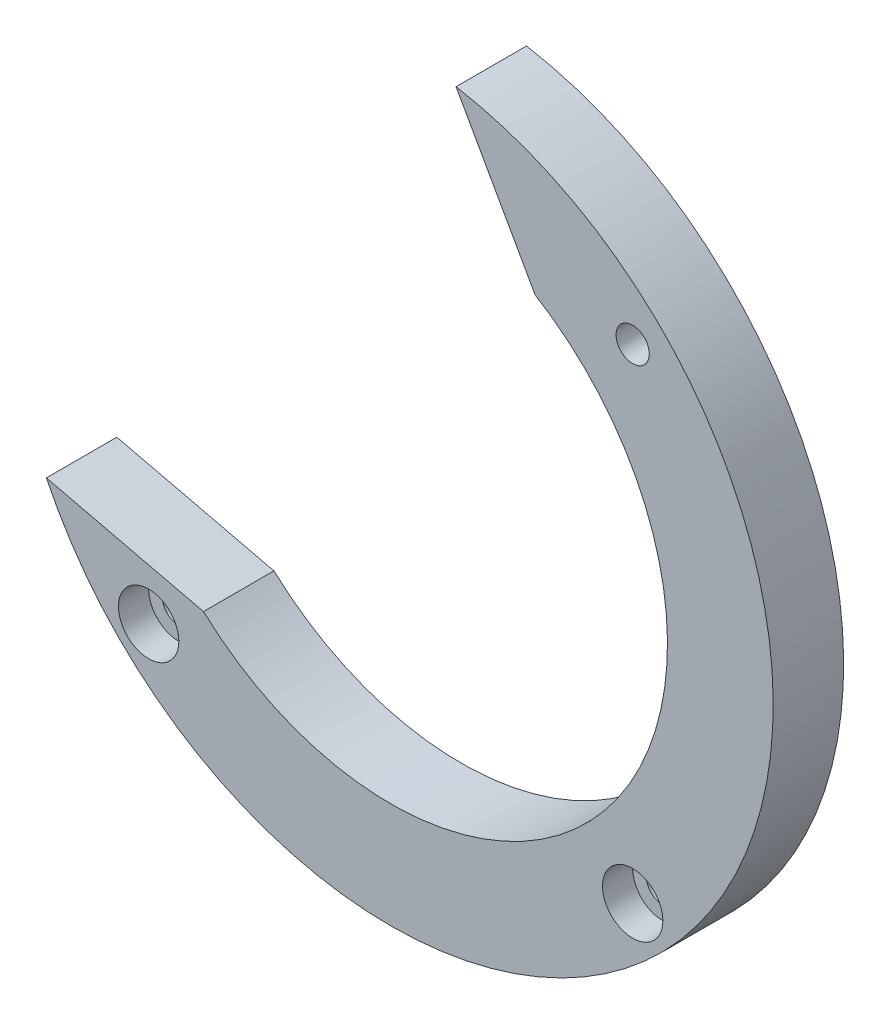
ISO-10303-21;
HEADER;
FILE_DESCRIPTION(('STEP AP214'),'2;1');
FILE_NAME('part.step','',(''),(''),'','','');
FILE_SCHEMA(('AUTOMOTIVE_DESIGN { 1 0 10303 214 1 1 1 1 }'));
ENDSEC;
DATA;
#1=APPLICATION_CONTEXT('core data for automotive mechanical design processes');
#2=APPLICATION_PROTOCOL_DEFINITION('international standard','automotive_design',2000,#1);
#3=PRODUCT_CONTEXT('',#1,'mechanical');
#4=PRODUCT('Part','Part','',(#3));
#5=PRODUCT_RELATED_PRODUCT_CATEGORY('part','',(#4));
#6=PRODUCT_DEFINITION_FORMATION('','',#4);
#7=PRODUCT_DEFINITION_CONTEXT('part definition',#1,'design');
#8=PRODUCT_DEFINITION('design','',#6,#7);
#9=PRODUCT_DEFINITION_SHAPE('','',#8);
#10=(LENGTH_UNIT() NAMED_UNIT(*) SI_UNIT(.MILLI.,.METRE.));
#11=(NAMED_UNIT(*) PLANE_ANGLE_UNIT() SI_UNIT($,.RADIAN.));
#12=(NAMED_UNIT(*) SI_UNIT($,.STERADIAN.) SOLID_ANGLE_UNIT());
#13=UNCERTAINTY_MEASURE_WITH_UNIT(LENGTH_MEASURE(1.E-05),#10,'distance_accuracy_value','');
#14=(GEOMETRIC_REPRESENTATION_CONTEXT(3) GLOBAL_UNCERTAINTY_ASSIGNED_CONTEXT((#13)) GLOBAL_UNIT_ASSIGNED_CONTEXT((#10,
#11,#12)) REPRESENTATION_CONTEXT('',''));
#15=CARTESIAN_POINT('',(0.,0.,0.));
#16=DIRECTION('',(0.,0.,1.));
#17=DIRECTION('',(1.,0.,0.));
#18=AXIS2_PLACEMENT_3D('',#15,#16,#17);
#19=CARTESIAN_POINT('',(-24.0416305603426,-24.0416305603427,4.));
#20=DIRECTION('',(0.,0.,1.));
#21=DIRECTION('',(1.,0.,0.));
#22=AXIS2_PLACEMENT_3D('',#19,#20,#21);
#23=PLANE('',#22);
#24=CARTESIAN_POINT('',(-24.0416305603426,-24.0416305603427,4.));
#25=DIRECTION('',(0.,0.,1.));
#26=DIRECTION('',(1.,0.,0.));
#27=AXIS2_PLACEMENT_3D('',#24,#25,#26);
#28=CIRCLE('',#27,1.65);
#29=CARTESIAN_POINT('',(-22.3916305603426,-24.0416305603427,4.));
#30=VERTEX_POINT('',#29);
#31=EDGE_CURVE('E117',#30,#30,#28,.T.);
#32=ORIENTED_EDGE('',*,*,#31,.F.);
#33=EDGE_LOOP('',(#32));
#34=FACE_BOUND('',#33,.T.);
#35=CARTESIAN_POINT('',(-24.0416305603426,-24.0416305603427,4.));
#36=DIRECTION('',(0.,0.,1.));
#37=DIRECTION('',(1.,0.,0.));
#38=AXIS2_PLACEMENT_3D('',#35,#36,#37);
#39=CIRCLE('',#38,3.);
#40=CARTESIAN_POINT('',(-21.0416305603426,-24.0416305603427,4.));
#41=VERTEX_POINT('',#40);
#42=EDGE_CURVE('E254',#41,#41,#39,.T.);
#43=ORIENTED_EDGE('',*,*,#42,.T.);
#44=EDGE_LOOP('',(#43));
#45=FACE_BOUND('',#44,.T.);
#46=ADVANCED_FACE('F17',(#34,#45),#23,.T.);
#47=CARTESIAN_POINT('',(24.0416305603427,-24.0416305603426,4.));
#48=DIRECTION('',(0.,0.,1.));
#49=DIRECTION('',(1.,0.,0.));
#50=AXIS2_PLACEMENT_3D('',#47,#48,#49);
#51=PLANE('',#50);
#52=CARTESIAN_POINT('',(24.0416305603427,-24.0416305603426,4.));
#53=DIRECTION('',(0.,0.,1.));
#54=DIRECTION('',(1.,0.,0.));
#55=AXIS2_PLACEMENT_3D('',#52,#53,#54);
#56=CIRCLE('',#55,1.65);
#57=CARTESIAN_POINT('',(25.6916305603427,-24.0416305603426,4.));
#58=VERTEX_POINT('',#57);
#59=EDGE_CURVE('E122',#58,#58,#56,.T.);
#60=ORIENTED_EDGE('',*,*,#59,.F.);
#61=EDGE_LOOP('',(#60));
#62=FACE_BOUND('',#61,.T.);
#63=CARTESIAN_POINT('',(24.0416305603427,-24.0416305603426,4.));
#64=DIRECTION('',(0.,0.,1.));
#65=DIRECTION('',(1.,0.,0.));
#66=AXIS2_PLACEMENT_3D('',#63,#64,#65);
#67=CIRCLE('',#66,3.);
#68=CARTESIAN_POINT('',(27.0416305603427,-24.0416305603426,4.));
#69=VERTEX_POINT('',#68);
#70=EDGE_CURVE('E106',#69,#69,#67,.T.);
#71=ORIENTED_EDGE('',*,*,#70,.T.);
#72=EDGE_LOOP('',(#71));
#73=FACE_BOUND('',#72,.T.);
#74=ADVANCED_FACE('F429',(#62,#73),#51,.T.);
#75=CARTESIAN_POINT('',(0.,0.,7.));
#76=DIRECTION('',(0.,0.,1.));
#77=DIRECTION('',(1.,0.,0.));
#78=AXIS2_PLACEMENT_3D('',#75,#76,#77);
#79=PLANE('',#78);
#80=CARTESIAN_POINT('',(24.0416305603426,24.0416305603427,7.));
#81=DIRECTION('',(0.,0.,1.));
#82=DIRECTION('',(1.,0.,0.));
#83=AXIS2_PLACEMENT_3D('',#80,#81,#82);
#84=CIRCLE('',#83,1.65);
#85=CARTESIAN_POINT('',(25.6916305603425,24.0416305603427,7.));
#86=VERTEX_POINT('',#85);
#87=EDGE_CURVE('E112',#86,#86,#84,.T.);
#88=ORIENTED_EDGE('',*,*,#87,.F.);
#89=EDGE_LOOP('',(#88));
#90=FACE_BOUND('',#89,.T.);
#91=CARTESIAN_POINT('',(24.0416305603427,-24.0416305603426,7.));
#92=DIRECTION('',(0.,0.,1.));
#93=DIRECTION('',(1.,0.,0.));
#94=AXIS2_PLACEMENT_3D('',#91,#92,#93);
#95=CIRCLE('',#94,3.);
#96=CARTESIAN_POINT('',(27.0416305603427,-24.0416305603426,7.));
#97=VERTEX_POINT('',#96);
#98=EDGE_CURVE('E108',#97,#97,#95,.T.);
#99=ORIENTED_EDGE('',*,*,#98,.F.);
#100=EDGE_LOOP('',(#99));
#101=FACE_BOUND('',#100,.T.);
#102=CARTESIAN_POINT('',(-24.0416305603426,-24.0416305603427,7.));
#103=DIRECTION('',(0.,0.,1.));
#104=DIRECTION('',(1.,0.,0.));
#105=AXIS2_PLACEMENT_3D('',#102,#103,#104);
#106=CIRCLE('',#105,3.);
#107=CARTESIAN_POINT('',(-21.0416305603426,-24.0416305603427,7.));
#108=VERTEX_POINT('',#107);
#109=EDGE_CURVE('E232',#108,#108,#106,.T.);
#110=ORIENTED_EDGE('',*,*,#109,.F.);
#111=EDGE_LOOP('',(#110));
#112=FACE_BOUND('',#111,.T.);
#113=CARTESIAN_POINT('',(0.,0.,7.));
#114=DIRECTION('',(0.,0.,-1.));
#115=DIRECTION('',(1.,0.,0.));
#116=AXIS2_PLACEMENT_3D('',#113,#114,#115);
#117=CIRCLE('',#116,27.5);
#118=CARTESIAN_POINT('',(14.3472547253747,23.4607391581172,7.));
#119=VERTEX_POINT('',#118);
#120=CARTESIAN_POINT('',(-18.5972705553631,-20.2581225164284,7.));
#121=VERTEX_POINT('',#120);
#122=EDGE_CURVE('E11',#119,#121,#117,.T.);
#123=ORIENTED_EDGE('',*,*,#122,.T.);
#124=DIRECTION('',(-0.973060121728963,0.230551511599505,0.));
#125=VECTOR('',#124,1.);
#126=CARTESIAN_POINT('',(-18.5972705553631,-20.2581225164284,7.));
#127=LINE('',#126,#125);
#128=CARTESIAN_POINT('',(-34.2013776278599,-16.560971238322,7.));
#129=VERTEX_POINT('',#128);
#130=EDGE_CURVE('E102',#121,#129,#127,.T.);
#131=ORIENTED_EDGE('',*,*,#130,.T.);
#132=CARTESIAN_POINT('',(0.,0.,7.));
#133=DIRECTION('',(0.,0.,1.));
#134=DIRECTION('',(1.,0.,0.));
#135=AXIS2_PLACEMENT_3D('',#132,#133,#134);
#136=CIRCLE('',#135,38.);
#137=CARTESIAN_POINT('',(6.49225000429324,37.4412965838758,7.));
#138=VERTEX_POINT('',#137);
#139=EDGE_CURVE('E80',#129,#138,#136,.T.);
#140=ORIENTED_EDGE('',*,*,#139,.T.);
#141=DIRECTION('',(0.48983205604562,-0.871816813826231,0.));
#142=VECTOR('',#141,1.);
#143=CARTESIAN_POINT('',(6.49225000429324,37.4412965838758,7.));
#144=LINE('',#143,#142);
#145=EDGE_CURVE('E85',#138,#119,#144,.T.);
#146=ORIENTED_EDGE('',*,*,#145,.T.);
#147=EDGE_LOOP('',(#123,#131,#140,#146));
#148=FACE_BOUND('',#147,.T.);
#149=ADVANCED_FACE('F434',(#90,#101,#112,#148),#79,.T.);
#150=CARTESIAN_POINT('',(0.,0.,0.));
#151=DIRECTION('',(0.,0.,1.));
#152=DIRECTION('',(1.,0.,0.));
#153=AXIS2_PLACEMENT_3D('',#150,#151,#152);
#154=PLANE('',#153);
#155=CARTESIAN_POINT('',(24.0416305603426,24.0416305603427,0.));
#156=DIRECTION('',(0.,0.,1.));
#157=DIRECTION('',(1.,0.,0.));
#158=AXIS2_PLACEMENT_3D('',#155,#156,#157);
#159=CIRCLE('',#158,1.65);
#160=CARTESIAN_POINT('',(25.6916305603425,24.0416305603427,0.));
#161=VERTEX_POINT('',#160);
#162=EDGE_CURVE('E116',#161,#161,#159,.T.);
#163=ORIENTED_EDGE('',*,*,#162,.T.);
#164=EDGE_LOOP('',(#163));
#165=FACE_BOUND('',#164,.T.);
#166=CARTESIAN_POINT('',(24.0416305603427,-24.0416305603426,0.));
#167=DIRECTION('',(0.,0.,1.));
#168=DIRECTION('',(1.,0.,0.));
#169=AXIS2_PLACEMENT_3D('',#166,#167,#168);
#170=CIRCLE('',#169,1.65);
#171=CARTESIAN_POINT('',(25.6916305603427,-24.0416305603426,0.));
#172=VERTEX_POINT('',#171);
#173=EDGE_CURVE('E126',#172,#172,#170,.T.);
#174=ORIENTED_EDGE('',*,*,#173,.T.);
#175=EDGE_LOOP('',(#174));
#176=FACE_BOUND('',#175,.T.);
#177=CARTESIAN_POINT('',(-24.0416305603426,-24.0416305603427,0.));
#178=DIRECTION('',(0.,0.,1.));
#179=DIRECTION('',(1.,0.,0.));
#180=AXIS2_PLACEMENT_3D('',#177,#178,#179);
#181=CIRCLE('',#180,1.65);
#182=CARTESIAN_POINT('',(-22.3916305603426,-24.0416305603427,0.));
#183=VERTEX_POINT('',#182);
#184=EDGE_CURVE('E121',#183,#183,#181,.T.);
#185=ORIENTED_EDGE('',*,*,#184,.T.);
#186=EDGE_LOOP('',(#185));
#187=FACE_BOUND('',#186,.T.);
#188=DIRECTION('',(0.973060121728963,-0.230551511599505,0.));
#189=VECTOR('',#188,1.);
#190=CARTESIAN_POINT('',(-5.53323627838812,-23.3534429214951,0.));
#191=LINE('',#190,#189);
#192=CARTESIAN_POINT('',(-34.2013776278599,-16.560971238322,0.));
#193=VERTEX_POINT('',#192);
#194=CARTESIAN_POINT('',(-18.5972705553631,-20.2581225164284,0.));
#195=VERTEX_POINT('',#194);
#196=EDGE_CURVE('E130',#193,#195,#191,.T.);
#197=ORIENTED_EDGE('',*,*,#196,.T.);
#198=CARTESIAN_POINT('',(0.,0.,0.));
#199=DIRECTION('',(0.,0.,1.));
#200=DIRECTION('',(1.,0.,0.));
#201=AXIS2_PLACEMENT_3D('',#198,#199,#200);
#202=CIRCLE('',#201,27.5);
#203=CARTESIAN_POINT('',(14.3472547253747,23.4607391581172,0.));
#204=VERTEX_POINT('',#203);
#205=EDGE_CURVE('E25',#195,#204,#202,.T.);
#206=ORIENTED_EDGE('',*,*,#205,.T.);
#207=DIRECTION('',(-0.489832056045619,0.871816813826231,0.));
#208=VECTOR('',#207,1.);
#209=CARTESIAN_POINT('',(20.9236035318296,11.7559693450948,0.));
#210=LINE('',#209,#208);
#211=CARTESIAN_POINT('',(6.49225000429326,37.4412965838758,0.));
#212=VERTEX_POINT('',#211);
#213=EDGE_CURVE('E70',#204,#212,#210,.T.);
#214=ORIENTED_EDGE('',*,*,#213,.T.);
#215=CARTESIAN_POINT('',(0.,0.,0.));
#216=DIRECTION('',(0.,0.,1.));
#217=DIRECTION('',(1.,0.,0.));
#218=AXIS2_PLACEMENT_3D('',#215,#216,#217);
#219=CIRCLE('',#218,38.);
#220=EDGE_CURVE('E74',#193,#212,#219,.T.);
#221=ORIENTED_EDGE('',*,*,#220,.F.);
#222=EDGE_LOOP('',(#197,#206,#214,#221));
#223=FACE_BOUND('',#222,.T.);
#224=ADVANCED_FACE('F72',(#165,#176,#187,#223),#154,.F.);
#225=CARTESIAN_POINT('',(0.,0.,2.));
#226=DIRECTION('',(0.,0.,-1.));
#227=DIRECTION('',(-1.,0.,0.));
#228=AXIS2_PLACEMENT_3D('',#225,#226,#227);
#229=CYLINDRICAL_SURFACE('',#228,27.5);
#230=ORIENTED_EDGE('',*,*,#205,.F.);
#231=DIRECTION('',(0.,0.,-1.));
#232=VECTOR('',#231,1.);
#233=CARTESIAN_POINT('',(-18.5972705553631,-20.2581225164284,2.));
#234=LINE('',#233,#232);
#235=EDGE_CURVE('E95',#121,#195,#234,.T.);
#236=ORIENTED_EDGE('',*,*,#235,.F.);
#237=ORIENTED_EDGE('',*,*,#122,.F.);
#238=DIRECTION('',(0.,0.,-1.));
#239=VECTOR('',#238,1.);
#240=CARTESIAN_POINT('',(14.3472547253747,23.4607391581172,2.));
#241=LINE('',#240,#239);
#242=EDGE_CURVE('E79',#119,#204,#241,.T.);
#243=ORIENTED_EDGE('',*,*,#242,.T.);
#244=EDGE_LOOP('',(#230,#236,#237,#243));
#245=FACE_BOUND('',#244,.T.);
#246=ADVANCED_FACE('F452',(#245),#229,.F.);
#247=CARTESIAN_POINT('',(20.9236035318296,11.7559693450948,2.));
#248=DIRECTION('',(-0.871816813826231,-0.489832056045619,0.));
#249=DIRECTION('',(-0.489832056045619,0.871816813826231,0.));
#250=AXIS2_PLACEMENT_3D('',#247,#248,#249);
#251=PLANE('',#250);
#252=ORIENTED_EDGE('',*,*,#213,.F.);
#253=ORIENTED_EDGE('',*,*,#242,.F.);
#254=ORIENTED_EDGE('',*,*,#145,.F.);
#255=DIRECTION('',(0.,0.,-1.));
#256=VECTOR('',#255,1.);
#257=CARTESIAN_POINT('',(6.49225000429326,37.4412965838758,2.));
#258=LINE('',#257,#256);
#259=EDGE_CURVE('E83',#138,#212,#258,.T.);
#260=ORIENTED_EDGE('',*,*,#259,.T.);
#261=EDGE_LOOP('',(#252,#253,#254,#260));
#262=FACE_BOUND('',#261,.T.);
#263=ADVANCED_FACE('F84',(#262),#251,.T.);
#264=CARTESIAN_POINT('',(0.,0.,2.));
#265=DIRECTION('',(0.,0.,-1.));
#266=DIRECTION('',(-1.,0.,0.));
#267=AXIS2_PLACEMENT_3D('',#264,#265,#266);
#268=CYLINDRICAL_SURFACE('',#267,38.);
#269=ORIENTED_EDGE('',*,*,#220,.T.);
#270=ORIENTED_EDGE('',*,*,#259,.F.);
#271=ORIENTED_EDGE('',*,*,#139,.F.);
#272=DIRECTION('',(0.,0.,-1.));
#273=VECTOR('',#272,1.);
#274=CARTESIAN_POINT('',(-34.2013776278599,-16.560971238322,2.));
#275=LINE('',#274,#273);
#276=EDGE_CURVE('E92',#129,#193,#275,.T.);
#277=ORIENTED_EDGE('',*,*,#276,.T.);
#278=EDGE_LOOP('',(#269,#270,#271,#277));
#279=FACE_BOUND('',#278,.T.);
#280=ADVANCED_FACE('F90',(#279),#268,.T.);
#281=CARTESIAN_POINT('',(-5.53323627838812,-23.3534429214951,2.));
#282=DIRECTION('',(0.230551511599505,0.973060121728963,0.));
#283=DIRECTION('',(0.,0.,-1.));
#284=AXIS2_PLACEMENT_3D('',#281,#282,#283);
#285=PLANE('',#284);
#286=ORIENTED_EDGE('',*,*,#196,.F.);
#287=ORIENTED_EDGE('',*,*,#276,.F.);
#288=ORIENTED_EDGE('',*,*,#130,.F.);
#289=ORIENTED_EDGE('',*,*,#235,.T.);
#290=EDGE_LOOP('',(#286,#287,#288,#289));
#291=FACE_BOUND('',#290,.T.);
#292=ADVANCED_FACE('F338',(#291),#285,.T.);
#293=CARTESIAN_POINT('',(24.0416305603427,-24.0416305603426,2.));
#294=DIRECTION('',(0.,0.,-1.));
#295=DIRECTION('',(-1.,0.,0.));
#296=AXIS2_PLACEMENT_3D('',#293,#294,#295);
#297=CYLINDRICAL_SURFACE('',#296,1.65);
#298=ORIENTED_EDGE('',*,*,#173,.F.);
#299=EDGE_LOOP('',(#298));
#300=FACE_BOUND('',#299,.T.);
#301=ORIENTED_EDGE('',*,*,#59,.T.);
#302=EDGE_LOOP('',(#301));
#303=FACE_BOUND('',#302,.T.);
#304=ADVANCED_FACE('F327',(#300,#303),#297,.F.);
#305=CARTESIAN_POINT('',(-24.0416305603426,-24.0416305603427,2.));
#306=DIRECTION('',(0.,0.,-1.));
#307=DIRECTION('',(-1.,0.,0.));
#308=AXIS2_PLACEMENT_3D('',#305,#306,#307);
#309=CYLINDRICAL_SURFACE('',#308,1.65);
#310=ORIENTED_EDGE('',*,*,#184,.F.);
#311=EDGE_LOOP('',(#310));
#312=FACE_BOUND('',#311,.T.);
#313=ORIENTED_EDGE('',*,*,#31,.T.);
#314=EDGE_LOOP('',(#313));
#315=FACE_BOUND('',#314,.T.);
#316=ADVANCED_FACE('F315',(#312,#315),#309,.F.);
#317=CARTESIAN_POINT('',(24.0416305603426,24.0416305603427,2.));
#318=DIRECTION('',(0.,0.,-1.));
#319=DIRECTION('',(-1.,0.,0.));
#320=AXIS2_PLACEMENT_3D('',#317,#318,#319);
#321=CYLINDRICAL_SURFACE('',#320,1.65);
#322=ORIENTED_EDGE('',*,*,#162,.F.);
#323=EDGE_LOOP('',(#322));
#324=FACE_BOUND('',#323,.T.);
#325=ORIENTED_EDGE('',*,*,#87,.T.);
#326=EDGE_LOOP('',(#325));
#327=FACE_BOUND('',#326,.T.);
#328=ADVANCED_FACE('F303',(#324,#327),#321,.F.);
#329=CARTESIAN_POINT('',(24.0416305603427,-24.0416305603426,4.));
#330=DIRECTION('',(0.,0.,1.));
#331=DIRECTION('',(1.,0.,0.));
#332=AXIS2_PLACEMENT_3D('',#329,#330,#331);
#333=CYLINDRICAL_SURFACE('',#332,3.);
#334=ORIENTED_EDGE('',*,*,#98,.T.);
#335=EDGE_LOOP('',(#334));
#336=FACE_BOUND('',#335,.T.);
#337=ORIENTED_EDGE('',*,*,#70,.F.);
#338=EDGE_LOOP('',(#337));
#339=FACE_BOUND('',#338,.T.);
#340=ADVANCED_FACE('F290',(#336,#339),#333,.F.);
#341=CARTESIAN_POINT('',(-24.0416305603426,-24.0416305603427,4.));
#342=DIRECTION('',(0.,0.,1.));
#343=DIRECTION('',(1.,0.,0.));
#344=AXIS2_PLACEMENT_3D('',#341,#342,#343);
#345=CYLINDRICAL_SURFACE('',#344,3.);
#346=ORIENTED_EDGE('',*,*,#109,.T.);
#347=EDGE_LOOP('',(#346));
#348=FACE_BOUND('',#347,.T.);
#349=ORIENTED_EDGE('',*,*,#42,.F.);
#350=EDGE_LOOP('',(#349));
#351=FACE_BOUND('',#350,.T.);
#352=ADVANCED_FACE('F285',(#348,#351),#345,.F.);
#353=CLOSED_SHELL('',(#46,#74,#149,#224,#246,#263,#280,#292,#304,#316,#328,#340,#352));
#354=MANIFOLD_SOLID_BREP('B1',#353);
#355=ADVANCED_BREP_SHAPE_REPRESENTATION('',(#18,#354),#14);
#356=SHAPE_DEFINITION_REPRESENTATION(#9,#355);
ENDSEC;
END-ISO-10303-21;
